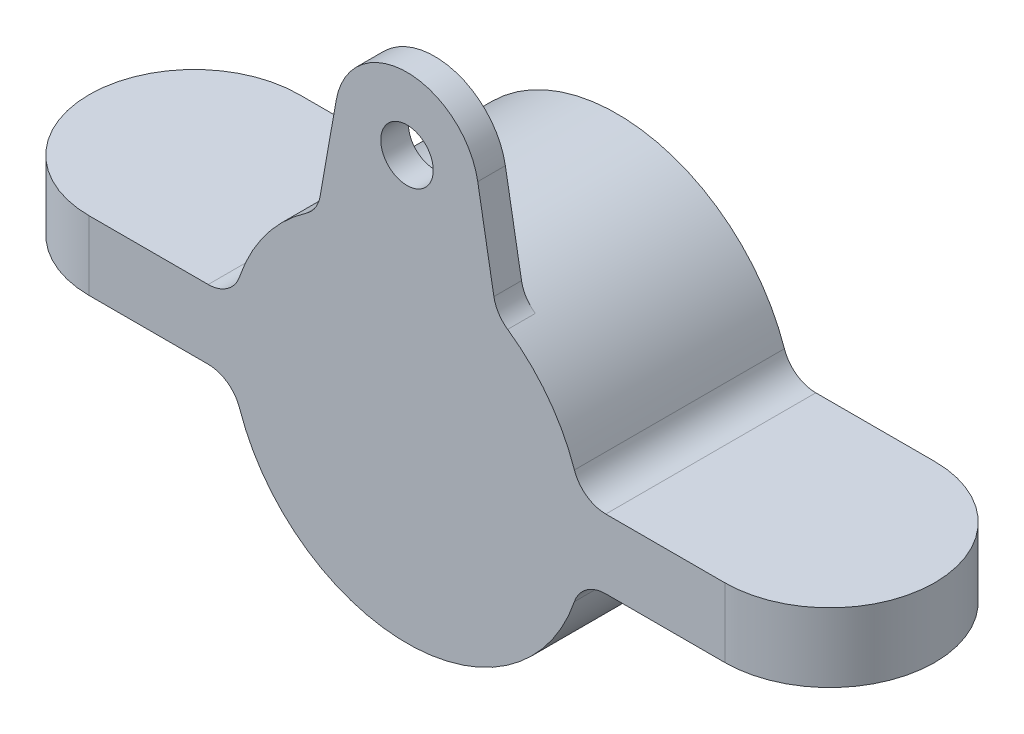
from build123d import *

# Parameters (mm, degrees)
MAIN_BODY_DEPTH           = 38
FULL_ROUND_FILLET1_RADIUS = 19
FULL_ROUND_FILLET1_LENGTH = 12.5
FULL_ROUND_FILLET2_RADIUS = 19
FULL_ROUND_FILLET2_LENGTH = 12.5
SKETCH2_R                 = 4.75
TAB_DEPTH                 = 5
FILLET1_R                 = 6


with BuildPart() as part:
    # Sketch1 → Main Body (new body)
    with BuildSketch(Plane.XY):
        with BuildLine():
            Line((31.383713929, 6.25), (76.5, 6.25))
            Line((76.5, 6.25), (76.5, -6.25))
            Line((76.5, -6.25), (31.383713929, -6.25))
            ThreePointArc((31.383713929, -6.25), (0, -32), (-31.383713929, -6.25))
            Line((-31.383713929, -6.25), (-76.5, -6.25))
            Line((-76.5, -6.25), (-76.5, 6.25))
            Line((-76.5, 6.25), (-31.383713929, 6.25))
            ThreePointArc((-31.383713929, 6.25), (0, 32), (31.383713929, 6.25))
        make_face()
    extrude(amount=-MAIN_BODY_DEPTH)

    # Full Round Fillet1: full round fillet: the end face becomes a half cylinder, R = half its width
    full_round_fillet1_face = Plane((76.5, 0, -19), x_dir=(0, 1, 0), z_dir=(1, 0, 0))  # on the end face: x along it, z out of the body
    full_round_fillet1_slab = full_round_fillet1_face.offset(-FULL_ROUND_FILLET1_RADIUS / 2) * Box(FULL_ROUND_FILLET1_LENGTH, 2 * FULL_ROUND_FILLET1_RADIUS, FULL_ROUND_FILLET1_RADIUS, mode=Mode.PRIVATE)  # the body's end, R deep
    full_round_fillet1_round = Plane((57.5, 0, -19), x_dir=(1, 0, 0), z_dir=(0, 1, 0)) * Cylinder(FULL_ROUND_FILLET1_RADIUS, FULL_ROUND_FILLET1_LENGTH, mode=Mode.PRIVATE)  # its axis R under the face
    add(full_round_fillet1_slab - full_round_fillet1_round, mode=Mode.SUBTRACT)

    # Full Round Fillet2: full round fillet: the end face becomes a half cylinder, R = half its width
    full_round_fillet2_face = Plane((-76.5, 0, -19), x_dir=(0, -1, 0), z_dir=(-1, 0, 0))  # on the end face: x along it, z out of the body
    full_round_fillet2_slab = full_round_fillet2_face.offset(-FULL_ROUND_FILLET2_RADIUS / 2) * Box(FULL_ROUND_FILLET2_LENGTH, 2 * FULL_ROUND_FILLET2_RADIUS, FULL_ROUND_FILLET2_RADIUS, mode=Mode.PRIVATE)  # the body's end, R deep
    full_round_fillet2_round = Plane((-57.5, 0, -19), x_dir=(-1, 0, 0), z_dir=(0, -1, 0)) * Cylinder(FULL_ROUND_FILLET2_RADIUS, FULL_ROUND_FILLET2_LENGTH, mode=Mode.PRIVATE)  # its axis R under the face
    add(full_round_fillet2_slab - full_round_fillet2_round, mode=Mode.SUBTRACT)

    # Sketch2 → Tab (add)
    with BuildSketch(Plane.XY):
        with BuildLine():
            Line((-16.178931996, 27.608733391), (-12.802500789, 46.75742631))
            ThreePointArc((-12.802500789, 46.75742631), (0, 57.5), (12.802500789, 46.75742631))
            Line((12.802500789, 46.75742631), (16.178931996, 27.608733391))
            ThreePointArc((16.178931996, 27.608733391), (0, 32), (-16.178931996, 27.608733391))
        make_face()
        with Locations((0, 44.5)):
            Circle(SKETCH2_R, mode=Mode.SUBTRACT)
    extrude(amount=-TAB_DEPTH)

    # Fillet1
    fillet1_edges = [part.edges().sort_by_distance(p)[0] for p in [
        (31.383713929, 6.25, -19),
        (31.383713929, -6.25, -19),
        (-31.383713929, -6.25, -19),
        (-31.383713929, 6.25, -19),
        (16.178931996, 27.608733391, -2.5),
        (-16.178931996, 27.608733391, -2.5),
    ]]
    fillet(fillet1_edges, radius=FILLET1_R)


solid = part.part
